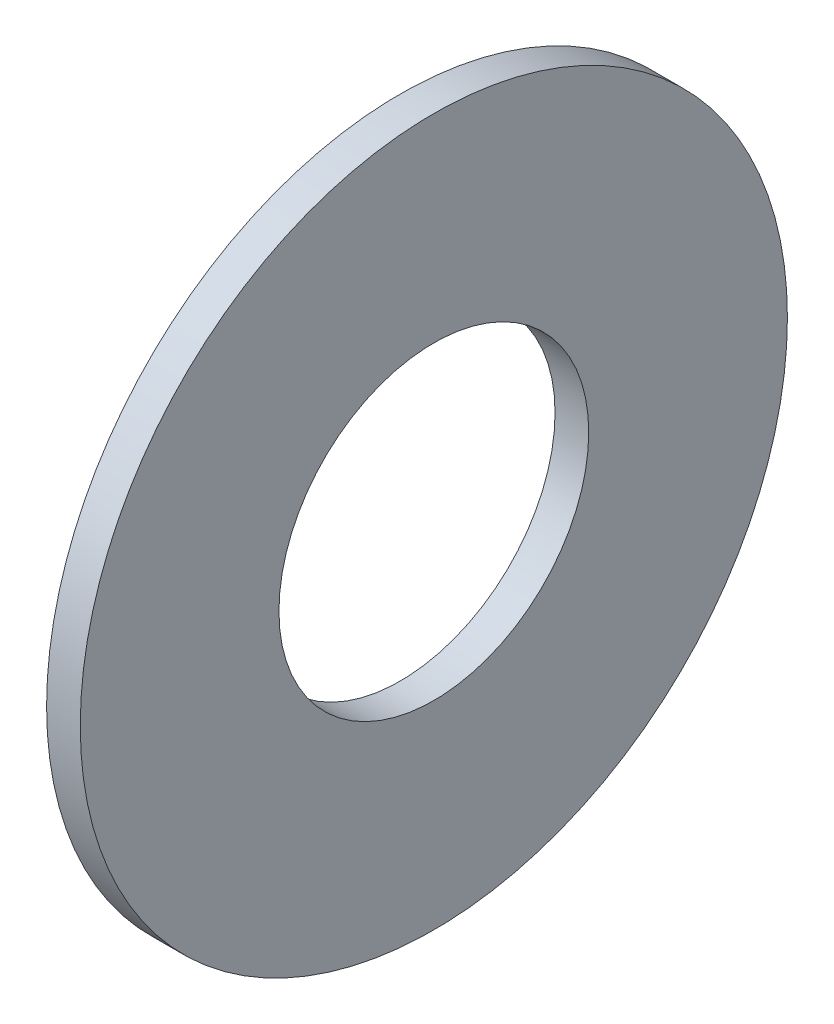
ISO-10303-21;
HEADER;
FILE_DESCRIPTION(('STEP AP214'),'2;1');
FILE_NAME('part.step','',(''),(''),'','','');
FILE_SCHEMA(('AUTOMOTIVE_DESIGN { 1 0 10303 214 1 1 1 1 }'));
ENDSEC;
DATA;
#1=APPLICATION_CONTEXT('core data for automotive mechanical design processes');
#2=APPLICATION_PROTOCOL_DEFINITION('international standard','automotive_design',2000,#1);
#3=PRODUCT_CONTEXT('',#1,'mechanical');
#4=PRODUCT('Part','Part','',(#3));
#5=PRODUCT_RELATED_PRODUCT_CATEGORY('part','',(#4));
#6=PRODUCT_DEFINITION_FORMATION('','',#4);
#7=PRODUCT_DEFINITION_CONTEXT('part definition',#1,'design');
#8=PRODUCT_DEFINITION('design','',#6,#7);
#9=PRODUCT_DEFINITION_SHAPE('','',#8);
#10=(LENGTH_UNIT() NAMED_UNIT(*) SI_UNIT(.MILLI.,.METRE.));
#11=(NAMED_UNIT(*) PLANE_ANGLE_UNIT() SI_UNIT($,.RADIAN.));
#12=(NAMED_UNIT(*) SI_UNIT($,.STERADIAN.) SOLID_ANGLE_UNIT());
#13=UNCERTAINTY_MEASURE_WITH_UNIT(LENGTH_MEASURE(1.E-05),#10,'distance_accuracy_value','');
#14=(GEOMETRIC_REPRESENTATION_CONTEXT(3) GLOBAL_UNCERTAINTY_ASSIGNED_CONTEXT((#13)) GLOBAL_UNIT_ASSIGNED_CONTEXT((#10,
#11,#12)) REPRESENTATION_CONTEXT('',''));
#15=CARTESIAN_POINT('',(0.,0.,0.));
#16=DIRECTION('',(0.,0.,1.));
#17=DIRECTION('',(1.,0.,0.));
#18=AXIS2_PLACEMENT_3D('',#15,#16,#17);
#19=CARTESIAN_POINT('',(1.,0.,0.));
#20=DIRECTION('',(1.,0.,0.));
#21=DIRECTION('',(0.,0.,-1.));
#22=AXIS2_PLACEMENT_3D('',#19,#20,#21);
#23=PLANE('',#22);
#24=CARTESIAN_POINT('',(1.,0.,0.));
#25=DIRECTION('',(1.,0.,0.));
#26=DIRECTION('',(0.,0.,-1.));
#27=AXIS2_PLACEMENT_3D('',#24,#25,#26);
#28=CIRCLE('',#27,10.5);
#29=CARTESIAN_POINT('',(1.,0.,-10.5));
#30=VERTEX_POINT('',#29);
#31=EDGE_CURVE('E10',#30,#30,#28,.T.);
#32=ORIENTED_EDGE('',*,*,#31,.T.);
#33=EDGE_LOOP('',(#32));
#34=FACE_BOUND('',#33,.T.);
#35=CARTESIAN_POINT('',(1.,0.,0.));
#36=DIRECTION('',(1.,0.,0.));
#37=DIRECTION('',(0.,0.,-1.));
#38=AXIS2_PLACEMENT_3D('',#35,#36,#37);
#39=CIRCLE('',#38,4.6);
#40=CARTESIAN_POINT('',(1.,0.,-4.6));
#41=VERTEX_POINT('',#40);
#42=EDGE_CURVE('E48',#41,#41,#39,.T.);
#43=ORIENTED_EDGE('',*,*,#42,.F.);
#44=EDGE_LOOP('',(#43));
#45=FACE_BOUND('',#44,.T.);
#46=ADVANCED_FACE('F37',(#34,#45),#23,.T.);
#47=CARTESIAN_POINT('',(0.,0.,0.));
#48=DIRECTION('',(1.,0.,0.));
#49=DIRECTION('',(0.,0.,-1.));
#50=AXIS2_PLACEMENT_3D('',#47,#48,#49);
#51=PLANE('',#50);
#52=CARTESIAN_POINT('',(0.,0.,0.));
#53=DIRECTION('',(1.,0.,0.));
#54=DIRECTION('',(0.,0.,-1.));
#55=AXIS2_PLACEMENT_3D('',#52,#53,#54);
#56=CIRCLE('',#55,10.5);
#57=CARTESIAN_POINT('',(0.,0.,-10.5));
#58=VERTEX_POINT('',#57);
#59=EDGE_CURVE('E41',#58,#58,#56,.T.);
#60=ORIENTED_EDGE('',*,*,#59,.F.);
#61=EDGE_LOOP('',(#60));
#62=FACE_BOUND('',#61,.T.);
#63=CARTESIAN_POINT('',(0.,0.,0.));
#64=DIRECTION('',(1.,0.,0.));
#65=DIRECTION('',(0.,0.,-1.));
#66=AXIS2_PLACEMENT_3D('',#63,#64,#65);
#67=CIRCLE('',#66,4.6);
#68=CARTESIAN_POINT('',(0.,0.,-4.6));
#69=VERTEX_POINT('',#68);
#70=EDGE_CURVE('E50',#69,#69,#67,.T.);
#71=ORIENTED_EDGE('',*,*,#70,.T.);
#72=EDGE_LOOP('',(#71));
#73=FACE_BOUND('',#72,.T.);
#74=ADVANCED_FACE('F60',(#62,#73),#51,.F.);
#75=CARTESIAN_POINT('',(1.,0.,0.));
#76=DIRECTION('',(-1.,0.,0.));
#77=DIRECTION('',(0.,0.,1.));
#78=AXIS2_PLACEMENT_3D('',#75,#76,#77);
#79=CYLINDRICAL_SURFACE('',#78,10.5);
#80=ORIENTED_EDGE('',*,*,#31,.F.);
#81=EDGE_LOOP('',(#80));
#82=FACE_BOUND('',#81,.T.);
#83=ORIENTED_EDGE('',*,*,#59,.T.);
#84=EDGE_LOOP('',(#83));
#85=FACE_BOUND('',#84,.T.);
#86=ADVANCED_FACE('F39',(#82,#85),#79,.T.);
#87=CARTESIAN_POINT('',(1.,0.,0.));
#88=DIRECTION('',(-1.,0.,0.));
#89=DIRECTION('',(0.,0.,1.));
#90=AXIS2_PLACEMENT_3D('',#87,#88,#89);
#91=CYLINDRICAL_SURFACE('',#90,4.6);
#92=ORIENTED_EDGE('',*,*,#42,.T.);
#93=EDGE_LOOP('',(#92));
#94=FACE_BOUND('',#93,.T.);
#95=ORIENTED_EDGE('',*,*,#70,.F.);
#96=EDGE_LOOP('',(#95));
#97=FACE_BOUND('',#96,.T.);
#98=ADVANCED_FACE('F56',(#94,#97),#91,.F.);
#99=CLOSED_SHELL('',(#46,#74,#86,#98));
#100=MANIFOLD_SOLID_BREP('B2',#99);
#101=ADVANCED_BREP_SHAPE_REPRESENTATION('',(#18,#100),#14);
#102=SHAPE_DEFINITION_REPRESENTATION(#9,#101);
ENDSEC;
END-ISO-10303-21;
